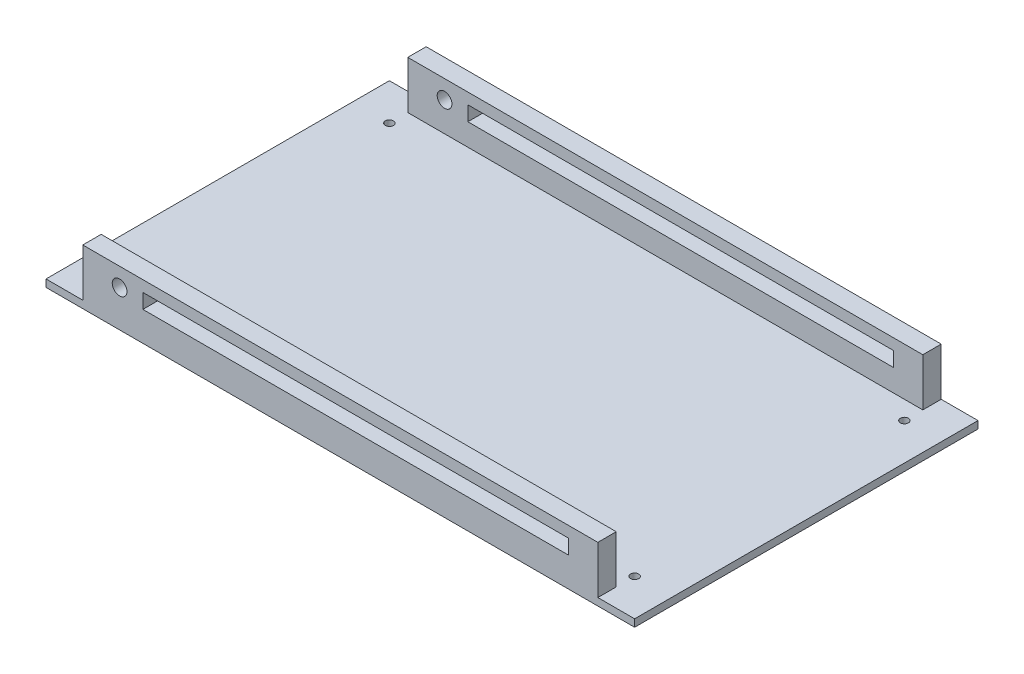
ISO-10303-21;
HEADER;
FILE_DESCRIPTION(('STEP AP214'),'2;1');
FILE_NAME('part.step','',(''),(''),'','','');
FILE_SCHEMA(('AUTOMOTIVE_DESIGN { 1 0 10303 214 1 1 1 1 }'));
ENDSEC;
DATA;
#1=APPLICATION_CONTEXT('core data for automotive mechanical design processes');
#2=APPLICATION_PROTOCOL_DEFINITION('international standard','automotive_design',2000,#1);
#3=PRODUCT_CONTEXT('',#1,'mechanical');
#4=PRODUCT('Part','Part','',(#3));
#5=PRODUCT_RELATED_PRODUCT_CATEGORY('part','',(#4));
#6=PRODUCT_DEFINITION_FORMATION('','',#4);
#7=PRODUCT_DEFINITION_CONTEXT('part definition',#1,'design');
#8=PRODUCT_DEFINITION('design','',#6,#7);
#9=PRODUCT_DEFINITION_SHAPE('','',#8);
#10=(LENGTH_UNIT() NAMED_UNIT(*) SI_UNIT(.MILLI.,.METRE.));
#11=(NAMED_UNIT(*) PLANE_ANGLE_UNIT() SI_UNIT($,.RADIAN.));
#12=(NAMED_UNIT(*) SI_UNIT($,.STERADIAN.) SOLID_ANGLE_UNIT());
#13=UNCERTAINTY_MEASURE_WITH_UNIT(LENGTH_MEASURE(1.E-05),#10,'distance_accuracy_value','');
#14=(GEOMETRIC_REPRESENTATION_CONTEXT(3) GLOBAL_UNCERTAINTY_ASSIGNED_CONTEXT((#13)) GLOBAL_UNIT_ASSIGNED_CONTEXT((#10,
#11,#12)) REPRESENTATION_CONTEXT('',''));
#15=CARTESIAN_POINT('',(0.,0.,0.));
#16=DIRECTION('',(0.,0.,1.));
#17=DIRECTION('',(1.,0.,0.));
#18=AXIS2_PLACEMENT_3D('',#15,#16,#17);
#19=CARTESIAN_POINT('',(210.,26.,-140.));
#20=DIRECTION('',(1.,0.,0.));
#21=DIRECTION('',(0.,0.,-1.));
#22=AXIS2_PLACEMENT_3D('',#19,#20,#21);
#23=PLANE('',#22);
#24=DIRECTION('',(0.,0.,1.));
#25=VECTOR('',#24,1.);
#26=CARTESIAN_POINT('',(210.,26.,-140.));
#27=LINE('',#26,#25);
#28=CARTESIAN_POINT('',(210.,26.,125.));
#29=VERTEX_POINT('',#28);
#30=CARTESIAN_POINT('',(210.,26.,140.));
#31=VERTEX_POINT('',#30);
#32=EDGE_CURVE('E257',#29,#31,#27,.T.);
#33=ORIENTED_EDGE('',*,*,#32,.F.);
#34=DIRECTION('',(0.,1.,0.));
#35=VECTOR('',#34,1.);
#36=CARTESIAN_POINT('',(210.,26.,125.));
#37=LINE('',#36,#35);
#38=CARTESIAN_POINT('',(210.,65.,125.));
#39=VERTEX_POINT('',#38);
#40=EDGE_CURVE('E228',#29,#39,#37,.T.);
#41=ORIENTED_EDGE('',*,*,#40,.T.);
#42=DIRECTION('',(0.,0.,1.));
#43=VECTOR('',#42,1.);
#44=CARTESIAN_POINT('',(210.,65.,-140.));
#45=LINE('',#44,#43);
#46=CARTESIAN_POINT('',(210.,65.,140.));
#47=VERTEX_POINT('',#46);
#48=EDGE_CURVE('E245',#39,#47,#45,.T.);
#49=ORIENTED_EDGE('',*,*,#48,.T.);
#50=DIRECTION('',(0.,1.,0.));
#51=VECTOR('',#50,1.);
#52=CARTESIAN_POINT('',(210.,26.,140.));
#53=LINE('',#52,#51);
#54=EDGE_CURVE('E235',#31,#47,#53,.T.);
#55=ORIENTED_EDGE('',*,*,#54,.F.);
#56=EDGE_LOOP('',(#33,#41,#49,#55));
#57=FACE_BOUND('',#56,.T.);
#58=ADVANCED_FACE('F41',(#57),#23,.T.);
#59=CARTESIAN_POINT('',(-210.,26.,-140.));
#60=DIRECTION('',(-1.,0.,0.));
#61=DIRECTION('',(0.,0.,1.));
#62=AXIS2_PLACEMENT_3D('',#59,#60,#61);
#63=PLANE('',#62);
#64=DIRECTION('',(0.,0.,1.));
#65=VECTOR('',#64,1.);
#66=CARTESIAN_POINT('',(-210.,65.,-140.));
#67=LINE('',#66,#65);
#68=CARTESIAN_POINT('',(-210.,65.,125.));
#69=VERTEX_POINT('',#68);
#70=CARTESIAN_POINT('',(-210.,65.,140.));
#71=VERTEX_POINT('',#70);
#72=EDGE_CURVE('E265',#69,#71,#67,.T.);
#73=ORIENTED_EDGE('',*,*,#72,.F.);
#74=DIRECTION('',(0.,-1.,0.));
#75=VECTOR('',#74,1.);
#76=CARTESIAN_POINT('',(-210.,26.,125.));
#77=LINE('',#76,#75);
#78=CARTESIAN_POINT('',(-210.,26.,125.));
#79=VERTEX_POINT('',#78);
#80=EDGE_CURVE('E223',#69,#79,#77,.T.);
#81=ORIENTED_EDGE('',*,*,#80,.T.);
#82=DIRECTION('',(0.,0.,1.));
#83=VECTOR('',#82,1.);
#84=CARTESIAN_POINT('',(-210.,26.,-140.));
#85=LINE('',#84,#83);
#86=CARTESIAN_POINT('',(-210.,26.,140.));
#87=VERTEX_POINT('',#86);
#88=EDGE_CURVE('E261',#79,#87,#85,.T.);
#89=ORIENTED_EDGE('',*,*,#88,.T.);
#90=DIRECTION('',(0.,-1.,0.));
#91=VECTOR('',#90,1.);
#92=CARTESIAN_POINT('',(-210.,26.,140.));
#93=LINE('',#92,#91);
#94=EDGE_CURVE('E240',#71,#87,#93,.T.);
#95=ORIENTED_EDGE('',*,*,#94,.F.);
#96=EDGE_LOOP('',(#73,#81,#89,#95));
#97=FACE_BOUND('',#96,.T.);
#98=ADVANCED_FACE('F388',(#97),#63,.T.);
#99=CARTESIAN_POINT('',(-210.,65.,-140.));
#100=DIRECTION('',(0.,1.,0.));
#101=DIRECTION('',(0.,0.,1.));
#102=AXIS2_PLACEMENT_3D('',#99,#100,#101);
#103=PLANE('',#102);
#104=ORIENTED_EDGE('',*,*,#48,.F.);
#105=DIRECTION('',(-1.,0.,0.));
#106=VECTOR('',#105,1.);
#107=CARTESIAN_POINT('',(-210.,65.,125.));
#108=LINE('',#107,#106);
#109=EDGE_CURVE('E297',#39,#69,#108,.T.);
#110=ORIENTED_EDGE('',*,*,#109,.T.);
#111=ORIENTED_EDGE('',*,*,#72,.T.);
#112=DIRECTION('',(-1.,0.,0.));
#113=VECTOR('',#112,1.);
#114=CARTESIAN_POINT('',(-210.,65.,140.));
#115=LINE('',#114,#113);
#116=EDGE_CURVE('E248',#47,#71,#115,.T.);
#117=ORIENTED_EDGE('',*,*,#116,.F.);
#118=EDGE_LOOP('',(#104,#110,#111,#117));
#119=FACE_BOUND('',#118,.T.);
#120=ADVANCED_FACE('F396',(#119),#103,.T.);
#121=CARTESIAN_POINT('',(240.,20.,-140.));
#122=DIRECTION('',(1.,0.,0.));
#123=DIRECTION('',(0.,0.,-1.));
#124=AXIS2_PLACEMENT_3D('',#121,#122,#123);
#125=PLANE('',#124);
#126=DIRECTION('',(0.,1.,0.));
#127=VECTOR('',#126,1.);
#128=CARTESIAN_POINT('',(240.,20.,140.));
#129=LINE('',#128,#127);
#130=CARTESIAN_POINT('',(240.,20.,140.));
#131=VERTEX_POINT('',#130);
#132=CARTESIAN_POINT('',(240.,26.,140.));
#133=VERTEX_POINT('',#132);
#134=EDGE_CURVE('E256',#131,#133,#129,.T.);
#135=ORIENTED_EDGE('',*,*,#134,.F.);
#136=DIRECTION('',(0.,0.,1.));
#137=VECTOR('',#136,1.);
#138=CARTESIAN_POINT('',(240.,20.,-140.));
#139=LINE('',#138,#137);
#140=CARTESIAN_POINT('',(240.,20.,-140.));
#141=VERTEX_POINT('',#140);
#142=EDGE_CURVE('E295',#141,#131,#139,.T.);
#143=ORIENTED_EDGE('',*,*,#142,.F.);
#144=DIRECTION('',(0.,1.,0.));
#145=VECTOR('',#144,1.);
#146=CARTESIAN_POINT('',(240.,20.,-140.));
#147=LINE('',#146,#145);
#148=CARTESIAN_POINT('',(240.,26.,-140.));
#149=VERTEX_POINT('',#148);
#150=EDGE_CURVE('E269',#141,#149,#147,.T.);
#151=ORIENTED_EDGE('',*,*,#150,.T.);
#152=DIRECTION('',(0.,0.,1.));
#153=VECTOR('',#152,1.);
#154=CARTESIAN_POINT('',(240.,26.,-140.));
#155=LINE('',#154,#153);
#156=EDGE_CURVE('E283',#149,#133,#155,.T.);
#157=ORIENTED_EDGE('',*,*,#156,.T.);
#158=EDGE_LOOP('',(#135,#143,#151,#157));
#159=FACE_BOUND('',#158,.T.);
#160=ADVANCED_FACE('F43',(#159),#125,.T.);
#161=CARTESIAN_POINT('',(-240.,20.,-140.));
#162=DIRECTION('',(0.,-1.,0.));
#163=DIRECTION('',(0.,0.,-1.));
#164=AXIS2_PLACEMENT_3D('',#161,#162,#163);
#165=PLANE('',#164);
#166=CARTESIAN_POINT('',(-210.,20.,-110.));
#167=DIRECTION('',(0.,-1.,0.));
#168=DIRECTION('',(0.,0.,-1.));
#169=AXIS2_PLACEMENT_3D('',#166,#167,#168);
#170=CIRCLE('',#169,3.3);
#171=CARTESIAN_POINT('',(-210.,20.,-113.3));
#172=VERTEX_POINT('',#171);
#173=EDGE_CURVE('E334',#172,#172,#170,.T.);
#174=ORIENTED_EDGE('',*,*,#173,.F.);
#175=EDGE_LOOP('',(#174));
#176=FACE_BOUND('',#175,.T.);
#177=CARTESIAN_POINT('',(210.,20.,110.));
#178=DIRECTION('',(0.,-1.,0.));
#179=DIRECTION('',(0.,0.,-1.));
#180=AXIS2_PLACEMENT_3D('',#177,#178,#179);
#181=CIRCLE('',#180,3.3);
#182=CARTESIAN_POINT('',(210.,20.,106.7));
#183=VERTEX_POINT('',#182);
#184=EDGE_CURVE('E323',#183,#183,#181,.T.);
#185=ORIENTED_EDGE('',*,*,#184,.F.);
#186=EDGE_LOOP('',(#185));
#187=FACE_BOUND('',#186,.T.);
#188=CARTESIAN_POINT('',(210.,20.,-110.));
#189=DIRECTION('',(0.,-1.,0.));
#190=DIRECTION('',(0.,0.,-1.));
#191=AXIS2_PLACEMENT_3D('',#188,#189,#190);
#192=CIRCLE('',#191,3.3);
#193=CARTESIAN_POINT('',(210.,20.,-113.3));
#194=VERTEX_POINT('',#193);
#195=EDGE_CURVE('E320',#194,#194,#192,.T.);
#196=ORIENTED_EDGE('',*,*,#195,.F.);
#197=EDGE_LOOP('',(#196));
#198=FACE_BOUND('',#197,.T.);
#199=CARTESIAN_POINT('',(-210.,20.,110.));
#200=DIRECTION('',(0.,-1.,0.));
#201=DIRECTION('',(0.,0.,-1.));
#202=AXIS2_PLACEMENT_3D('',#199,#200,#201);
#203=CIRCLE('',#202,3.3);
#204=CARTESIAN_POINT('',(-210.,20.,106.7));
#205=VERTEX_POINT('',#204);
#206=EDGE_CURVE('E317',#205,#205,#203,.T.);
#207=ORIENTED_EDGE('',*,*,#206,.F.);
#208=EDGE_LOOP('',(#207));
#209=FACE_BOUND('',#208,.T.);
#210=DIRECTION('',(1.,0.,0.));
#211=VECTOR('',#210,1.);
#212=CARTESIAN_POINT('',(-240.,20.,140.));
#213=LINE('',#212,#211);
#214=CARTESIAN_POINT('',(-240.,20.,140.));
#215=VERTEX_POINT('',#214);
#216=EDGE_CURVE('E273',#215,#131,#213,.T.);
#217=ORIENTED_EDGE('',*,*,#216,.F.);
#218=DIRECTION('',(0.,0.,1.));
#219=VECTOR('',#218,1.);
#220=CARTESIAN_POINT('',(-240.,20.,-140.));
#221=LINE('',#220,#219);
#222=CARTESIAN_POINT('',(-240.,20.,-140.));
#223=VERTEX_POINT('',#222);
#224=EDGE_CURVE('E298',#223,#215,#221,.T.);
#225=ORIENTED_EDGE('',*,*,#224,.F.);
#226=DIRECTION('',(1.,0.,0.));
#227=VECTOR('',#226,1.);
#228=CARTESIAN_POINT('',(-240.,20.,-140.));
#229=LINE('',#228,#227);
#230=EDGE_CURVE('E280',#223,#141,#229,.T.);
#231=ORIENTED_EDGE('',*,*,#230,.T.);
#232=ORIENTED_EDGE('',*,*,#142,.T.);
#233=EDGE_LOOP('',(#217,#225,#231,#232));
#234=FACE_BOUND('',#233,.T.);
#235=ADVANCED_FACE('F433',(#176,#187,#198,#209,#234),#165,.T.);
#236=CARTESIAN_POINT('',(-240.,20.,-140.));
#237=DIRECTION('',(-1.,0.,0.));
#238=DIRECTION('',(0.,0.,1.));
#239=AXIS2_PLACEMENT_3D('',#236,#237,#238);
#240=PLANE('',#239);
#241=DIRECTION('',(0.,-1.,0.));
#242=VECTOR('',#241,1.);
#243=CARTESIAN_POINT('',(-240.,20.,140.));
#244=LINE('',#243,#242);
#245=CARTESIAN_POINT('',(-240.,26.,140.));
#246=VERTEX_POINT('',#245);
#247=EDGE_CURVE('E290',#246,#215,#244,.T.);
#248=ORIENTED_EDGE('',*,*,#247,.F.);
#249=DIRECTION('',(0.,0.,1.));
#250=VECTOR('',#249,1.);
#251=CARTESIAN_POINT('',(-240.,26.,-140.));
#252=LINE('',#251,#250);
#253=CARTESIAN_POINT('',(-240.,26.,-140.));
#254=VERTEX_POINT('',#253);
#255=EDGE_CURVE('E300',#254,#246,#252,.T.);
#256=ORIENTED_EDGE('',*,*,#255,.F.);
#257=DIRECTION('',(0.,-1.,0.));
#258=VECTOR('',#257,1.);
#259=CARTESIAN_POINT('',(-240.,20.,-140.));
#260=LINE('',#259,#258);
#261=EDGE_CURVE('E277',#254,#223,#260,.T.);
#262=ORIENTED_EDGE('',*,*,#261,.T.);
#263=ORIENTED_EDGE('',*,*,#224,.T.);
#264=EDGE_LOOP('',(#248,#256,#262,#263));
#265=FACE_BOUND('',#264,.T.);
#266=ADVANCED_FACE('F440',(#265),#240,.T.);
#267=CARTESIAN_POINT('',(-240.,26.,-140.));
#268=DIRECTION('',(0.,1.,0.));
#269=DIRECTION('',(0.,0.,1.));
#270=AXIS2_PLACEMENT_3D('',#267,#268,#269);
#271=PLANE('',#270);
#272=CARTESIAN_POINT('',(-210.,26.,-110.));
#273=DIRECTION('',(0.,1.,0.));
#274=DIRECTION('',(0.,0.,1.));
#275=AXIS2_PLACEMENT_3D('',#272,#273,#274);
#276=CIRCLE('',#275,3.3);
#277=CARTESIAN_POINT('',(-210.,26.,-106.7));
#278=VERTEX_POINT('',#277);
#279=EDGE_CURVE('E45',#278,#278,#276,.T.);
#280=ORIENTED_EDGE('',*,*,#279,.F.);
#281=EDGE_LOOP('',(#280));
#282=FACE_BOUND('',#281,.T.);
#283=CARTESIAN_POINT('',(210.,26.,110.));
#284=DIRECTION('',(0.,1.,0.));
#285=DIRECTION('',(0.,0.,1.));
#286=AXIS2_PLACEMENT_3D('',#283,#284,#285);
#287=CIRCLE('',#286,3.3);
#288=CARTESIAN_POINT('',(210.,26.,113.3));
#289=VERTEX_POINT('',#288);
#290=EDGE_CURVE('E321',#289,#289,#287,.T.);
#291=ORIENTED_EDGE('',*,*,#290,.F.);
#292=EDGE_LOOP('',(#291));
#293=FACE_BOUND('',#292,.T.);
#294=CARTESIAN_POINT('',(210.,26.,-110.));
#295=DIRECTION('',(0.,1.,0.));
#296=DIRECTION('',(0.,0.,1.));
#297=AXIS2_PLACEMENT_3D('',#294,#295,#296);
#298=CIRCLE('',#297,3.3);
#299=CARTESIAN_POINT('',(210.,26.,-106.7));
#300=VERTEX_POINT('',#299);
#301=EDGE_CURVE('E318',#300,#300,#298,.T.);
#302=ORIENTED_EDGE('',*,*,#301,.F.);
#303=EDGE_LOOP('',(#302));
#304=FACE_BOUND('',#303,.T.);
#305=CARTESIAN_POINT('',(-210.,26.,110.));
#306=DIRECTION('',(0.,1.,0.));
#307=DIRECTION('',(0.,0.,1.));
#308=AXIS2_PLACEMENT_3D('',#305,#306,#307);
#309=CIRCLE('',#308,3.3);
#310=CARTESIAN_POINT('',(-210.,26.,113.3));
#311=VERTEX_POINT('',#310);
#312=EDGE_CURVE('E314',#311,#311,#309,.T.);
#313=ORIENTED_EDGE('',*,*,#312,.F.);
#314=EDGE_LOOP('',(#313));
#315=FACE_BOUND('',#314,.T.);
#316=CARTESIAN_POINT('',(210.,26.,-140.));
#317=VERTEX_POINT('',#316);
#318=CARTESIAN_POINT('',(210.,26.,-125.));
#319=VERTEX_POINT('',#318);
#320=EDGE_CURVE('E253',#317,#319,#27,.T.);
#321=ORIENTED_EDGE('',*,*,#320,.T.);
#322=DIRECTION('',(1.,0.,0.));
#323=VECTOR('',#322,1.);
#324=CARTESIAN_POINT('',(-215.,26.,-125.));
#325=LINE('',#324,#323);
#326=CARTESIAN_POINT('',(-210.,26.,-125.));
#327=VERTEX_POINT('',#326);
#328=EDGE_CURVE('E221',#327,#319,#325,.T.);
#329=ORIENTED_EDGE('',*,*,#328,.F.);
#330=CARTESIAN_POINT('',(-210.,26.,-140.));
#331=VERTEX_POINT('',#330);
#332=EDGE_CURVE('E258',#331,#327,#85,.T.);
#333=ORIENTED_EDGE('',*,*,#332,.F.);
#334=DIRECTION('',(-1.,0.,0.));
#335=VECTOR('',#334,1.);
#336=CARTESIAN_POINT('',(-240.,26.,-140.));
#337=LINE('',#336,#335);
#338=EDGE_CURVE('E272',#331,#254,#337,.T.);
#339=ORIENTED_EDGE('',*,*,#338,.T.);
#340=ORIENTED_EDGE('',*,*,#255,.T.);
#341=DIRECTION('',(-1.,0.,0.));
#342=VECTOR('',#341,1.);
#343=CARTESIAN_POINT('',(-240.,26.,140.));
#344=LINE('',#343,#342);
#345=EDGE_CURVE('E286',#87,#246,#344,.T.);
#346=ORIENTED_EDGE('',*,*,#345,.F.);
#347=ORIENTED_EDGE('',*,*,#88,.F.);
#348=DIRECTION('',(1.,0.,0.));
#349=VECTOR('',#348,1.);
#350=CARTESIAN_POINT('',(-215.,26.,125.));
#351=LINE('',#350,#349);
#352=EDGE_CURVE('E220',#79,#29,#351,.T.);
#353=ORIENTED_EDGE('',*,*,#352,.T.);
#354=ORIENTED_EDGE('',*,*,#32,.T.);
#355=EDGE_CURVE('E287',#133,#31,#344,.T.);
#356=ORIENTED_EDGE('',*,*,#355,.F.);
#357=ORIENTED_EDGE('',*,*,#156,.F.);
#358=EDGE_CURVE('E274',#149,#317,#337,.T.);
#359=ORIENTED_EDGE('',*,*,#358,.T.);
#360=EDGE_LOOP('',(#321,#329,#333,#339,#340,#346,#347,#353,#354,#356,#357,#359));
#361=FACE_BOUND('',#360,.T.);
#362=ADVANCED_FACE('F421',(#282,#293,#304,#315,#361),#271,.T.);
#363=CARTESIAN_POINT('',(0.,0.,-140.));
#364=DIRECTION('',(0.,0.,-1.));
#365=DIRECTION('',(-1.,0.,0.));
#366=AXIS2_PLACEMENT_3D('',#363,#364,#365);
#367=PLANE('',#366);
#368=DIRECTION('',(0.,-1.,0.));
#369=VECTOR('',#368,1.);
#370=CARTESIAN_POINT('',(186.,0.,-140.));
#371=LINE('',#370,#369);
#372=CARTESIAN_POINT('',(186.,56.,-140.));
#373=VERTEX_POINT('',#372);
#374=CARTESIAN_POINT('',(186.,44.,-140.));
#375=VERTEX_POINT('',#374);
#376=EDGE_CURVE('E191',#373,#375,#371,.T.);
#377=ORIENTED_EDGE('',*,*,#376,.F.);
#378=DIRECTION('',(1.,0.,0.));
#379=VECTOR('',#378,1.);
#380=CARTESIAN_POINT('',(0.,56.,-140.));
#381=LINE('',#380,#379);
#382=CARTESIAN_POINT('',(-161.,56.,-140.));
#383=VERTEX_POINT('',#382);
#384=EDGE_CURVE('E177',#383,#373,#381,.T.);
#385=ORIENTED_EDGE('',*,*,#384,.F.);
#386=DIRECTION('',(0.,1.,0.));
#387=VECTOR('',#386,1.);
#388=CARTESIAN_POINT('',(-161.,0.,-140.));
#389=LINE('',#388,#387);
#390=CARTESIAN_POINT('',(-161.,44.,-140.));
#391=VERTEX_POINT('',#390);
#392=EDGE_CURVE('E356',#391,#383,#389,.T.);
#393=ORIENTED_EDGE('',*,*,#392,.F.);
#394=DIRECTION('',(-1.,0.,0.));
#395=VECTOR('',#394,1.);
#396=CARTESIAN_POINT('',(0.,44.,-140.));
#397=LINE('',#396,#395);
#398=EDGE_CURVE('E201',#375,#391,#397,.T.);
#399=ORIENTED_EDGE('',*,*,#398,.F.);
#400=EDGE_LOOP('',(#377,#385,#393,#399));
#401=FACE_BOUND('',#400,.T.);
#402=CARTESIAN_POINT('',(-180.,50.,-140.));
#403=DIRECTION('',(0.,0.,-1.));
#404=DIRECTION('',(-1.,0.,0.));
#405=AXIS2_PLACEMENT_3D('',#402,#403,#404);
#406=CIRCLE('',#405,6.00000000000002);
#407=CARTESIAN_POINT('',(-186.,50.,-140.));
#408=VERTEX_POINT('',#407);
#409=EDGE_CURVE('E217',#408,#408,#406,.T.);
#410=ORIENTED_EDGE('',*,*,#409,.F.);
#411=EDGE_LOOP('',(#410));
#412=FACE_BOUND('',#411,.T.);
#413=ORIENTED_EDGE('',*,*,#150,.F.);
#414=ORIENTED_EDGE('',*,*,#230,.F.);
#415=ORIENTED_EDGE('',*,*,#261,.F.);
#416=ORIENTED_EDGE('',*,*,#338,.F.);
#417=DIRECTION('',(0.,-1.,0.));
#418=VECTOR('',#417,1.);
#419=CARTESIAN_POINT('',(-210.,26.,-140.));
#420=LINE('',#419,#418);
#421=CARTESIAN_POINT('',(-210.,65.,-140.));
#422=VERTEX_POINT('',#421);
#423=EDGE_CURVE('E243',#422,#331,#420,.T.);
#424=ORIENTED_EDGE('',*,*,#423,.F.);
#425=DIRECTION('',(-1.,0.,0.));
#426=VECTOR('',#425,1.);
#427=CARTESIAN_POINT('',(-210.,65.,-140.));
#428=LINE('',#427,#426);
#429=CARTESIAN_POINT('',(210.,65.,-140.));
#430=VERTEX_POINT('',#429);
#431=EDGE_CURVE('E239',#430,#422,#428,.T.);
#432=ORIENTED_EDGE('',*,*,#431,.F.);
#433=DIRECTION('',(0.,1.,0.));
#434=VECTOR('',#433,1.);
#435=CARTESIAN_POINT('',(210.,26.,-140.));
#436=LINE('',#435,#434);
#437=EDGE_CURVE('E236',#317,#430,#436,.T.);
#438=ORIENTED_EDGE('',*,*,#437,.F.);
#439=ORIENTED_EDGE('',*,*,#358,.F.);
#440=EDGE_LOOP('',(#413,#414,#415,#416,#424,#432,#438,#439));
#441=FACE_BOUND('',#440,.T.);
#442=ADVANCED_FACE('F199',(#401,#412,#441),#367,.T.);
#443=CARTESIAN_POINT('',(0.,0.,140.));
#444=DIRECTION('',(0.,0.,-1.));
#445=DIRECTION('',(-1.,0.,0.));
#446=AXIS2_PLACEMENT_3D('',#443,#444,#445);
#447=PLANE('',#446);
#448=DIRECTION('',(1.,0.,0.));
#449=VECTOR('',#448,1.);
#450=CARTESIAN_POINT('',(0.,56.,140.));
#451=LINE('',#450,#449);
#452=CARTESIAN_POINT('',(-161.,56.,140.));
#453=VERTEX_POINT('',#452);
#454=CARTESIAN_POINT('',(186.,56.,140.));
#455=VERTEX_POINT('',#454);
#456=EDGE_CURVE('E186',#453,#455,#451,.T.);
#457=ORIENTED_EDGE('',*,*,#456,.T.);
#458=DIRECTION('',(0.,-1.,0.));
#459=VECTOR('',#458,1.);
#460=CARTESIAN_POINT('',(186.,0.,140.));
#461=LINE('',#460,#459);
#462=CARTESIAN_POINT('',(186.,44.,140.));
#463=VERTEX_POINT('',#462);
#464=EDGE_CURVE('E203',#455,#463,#461,.T.);
#465=ORIENTED_EDGE('',*,*,#464,.T.);
#466=DIRECTION('',(-1.,0.,0.));
#467=VECTOR('',#466,1.);
#468=CARTESIAN_POINT('',(0.,44.,140.));
#469=LINE('',#468,#467);
#470=CARTESIAN_POINT('',(-161.,44.,140.));
#471=VERTEX_POINT('',#470);
#472=EDGE_CURVE('E361',#463,#471,#469,.T.);
#473=ORIENTED_EDGE('',*,*,#472,.T.);
#474=DIRECTION('',(0.,1.,0.));
#475=VECTOR('',#474,1.);
#476=CARTESIAN_POINT('',(-161.,0.,140.));
#477=LINE('',#476,#475);
#478=EDGE_CURVE('E353',#471,#453,#477,.T.);
#479=ORIENTED_EDGE('',*,*,#478,.T.);
#480=EDGE_LOOP('',(#457,#465,#473,#479));
#481=FACE_BOUND('',#480,.T.);
#482=CARTESIAN_POINT('',(-180.,50.,140.));
#483=DIRECTION('',(0.,0.,-1.));
#484=DIRECTION('',(-1.,0.,0.));
#485=AXIS2_PLACEMENT_3D('',#482,#483,#484);
#486=CIRCLE('',#485,6.00000000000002);
#487=CARTESIAN_POINT('',(-186.,50.,140.));
#488=VERTEX_POINT('',#487);
#489=EDGE_CURVE('E214',#488,#488,#486,.T.);
#490=ORIENTED_EDGE('',*,*,#489,.T.);
#491=EDGE_LOOP('',(#490));
#492=FACE_BOUND('',#491,.T.);
#493=ORIENTED_EDGE('',*,*,#134,.T.);
#494=ORIENTED_EDGE('',*,*,#355,.T.);
#495=ORIENTED_EDGE('',*,*,#54,.T.);
#496=ORIENTED_EDGE('',*,*,#116,.T.);
#497=ORIENTED_EDGE('',*,*,#94,.T.);
#498=ORIENTED_EDGE('',*,*,#345,.T.);
#499=ORIENTED_EDGE('',*,*,#247,.T.);
#500=ORIENTED_EDGE('',*,*,#216,.T.);
#501=EDGE_LOOP('',(#493,#494,#495,#496,#497,#498,#499,#500));
#502=FACE_BOUND('',#501,.T.);
#503=ADVANCED_FACE('F404',(#481,#492,#502),#447,.F.);
#504=DIRECTION('',(0.,1.,0.));
#505=VECTOR('',#504,1.);
#506=CARTESIAN_POINT('',(210.,26.,-125.));
#507=LINE('',#506,#505);
#508=CARTESIAN_POINT('',(210.,65.,-125.));
#509=VERTEX_POINT('',#508);
#510=EDGE_CURVE('E233',#319,#509,#507,.T.);
#511=ORIENTED_EDGE('',*,*,#510,.F.);
#512=ORIENTED_EDGE('',*,*,#320,.F.);
#513=ORIENTED_EDGE('',*,*,#437,.T.);
#514=EDGE_CURVE('E266',#430,#509,#45,.T.);
#515=ORIENTED_EDGE('',*,*,#514,.T.);
#516=EDGE_LOOP('',(#511,#512,#513,#515));
#517=FACE_BOUND('',#516,.T.);
#518=ADVANCED_FACE('F391',(#517),#23,.T.);
#519=DIRECTION('',(0.,-1.,0.));
#520=VECTOR('',#519,1.);
#521=CARTESIAN_POINT('',(-210.,26.,-125.));
#522=LINE('',#521,#520);
#523=CARTESIAN_POINT('',(-210.,65.,-125.));
#524=VERTEX_POINT('',#523);
#525=EDGE_CURVE('E231',#524,#327,#522,.T.);
#526=ORIENTED_EDGE('',*,*,#525,.F.);
#527=EDGE_CURVE('E262',#422,#524,#67,.T.);
#528=ORIENTED_EDGE('',*,*,#527,.F.);
#529=ORIENTED_EDGE('',*,*,#423,.T.);
#530=ORIENTED_EDGE('',*,*,#332,.T.);
#531=EDGE_LOOP('',(#526,#528,#529,#530));
#532=FACE_BOUND('',#531,.T.);
#533=ADVANCED_FACE('F399',(#532),#63,.T.);
#534=DIRECTION('',(-1.,0.,0.));
#535=VECTOR('',#534,1.);
#536=CARTESIAN_POINT('',(-210.,65.,-125.));
#537=LINE('',#536,#535);
#538=EDGE_CURVE('E306',#509,#524,#537,.T.);
#539=ORIENTED_EDGE('',*,*,#538,.F.);
#540=ORIENTED_EDGE('',*,*,#514,.F.);
#541=ORIENTED_EDGE('',*,*,#431,.T.);
#542=ORIENTED_EDGE('',*,*,#527,.T.);
#543=EDGE_LOOP('',(#539,#540,#541,#542));
#544=FACE_BOUND('',#543,.T.);
#545=ADVANCED_FACE('F410',(#544),#103,.T.);
#546=CARTESIAN_POINT('',(0.,0.,-125.));
#547=DIRECTION('',(0.,0.,-1.));
#548=DIRECTION('',(-1.,0.,0.));
#549=AXIS2_PLACEMENT_3D('',#546,#547,#548);
#550=PLANE('',#549);
#551=DIRECTION('',(1.,0.,0.));
#552=VECTOR('',#551,1.);
#553=CARTESIAN_POINT('',(0.,56.,-125.));
#554=LINE('',#553,#552);
#555=CARTESIAN_POINT('',(-161.,56.,-125.));
#556=VERTEX_POINT('',#555);
#557=CARTESIAN_POINT('',(186.,56.,-125.));
#558=VERTEX_POINT('',#557);
#559=EDGE_CURVE('E347',#556,#558,#554,.T.);
#560=ORIENTED_EDGE('',*,*,#559,.T.);
#561=DIRECTION('',(0.,-1.,0.));
#562=VECTOR('',#561,1.);
#563=CARTESIAN_POINT('',(186.,0.,-125.));
#564=LINE('',#563,#562);
#565=CARTESIAN_POINT('',(186.,44.,-125.));
#566=VERTEX_POINT('',#565);
#567=EDGE_CURVE('E194',#558,#566,#564,.T.);
#568=ORIENTED_EDGE('',*,*,#567,.T.);
#569=DIRECTION('',(-1.,0.,0.));
#570=VECTOR('',#569,1.);
#571=CARTESIAN_POINT('',(0.,44.,-125.));
#572=LINE('',#571,#570);
#573=CARTESIAN_POINT('',(-161.,44.,-125.));
#574=VERTEX_POINT('',#573);
#575=EDGE_CURVE('E358',#566,#574,#572,.T.);
#576=ORIENTED_EDGE('',*,*,#575,.T.);
#577=DIRECTION('',(0.,1.,0.));
#578=VECTOR('',#577,1.);
#579=CARTESIAN_POINT('',(-161.,0.,-125.));
#580=LINE('',#579,#578);
#581=EDGE_CURVE('E185',#574,#556,#580,.T.);
#582=ORIENTED_EDGE('',*,*,#581,.T.);
#583=EDGE_LOOP('',(#560,#568,#576,#582));
#584=FACE_BOUND('',#583,.T.);
#585=CARTESIAN_POINT('',(-180.,50.,-125.));
#586=DIRECTION('',(0.,0.,-1.));
#587=DIRECTION('',(-1.,0.,0.));
#588=AXIS2_PLACEMENT_3D('',#585,#586,#587);
#589=CIRCLE('',#588,6.00000000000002);
#590=CARTESIAN_POINT('',(-186.,50.,-125.));
#591=VERTEX_POINT('',#590);
#592=EDGE_CURVE('E206',#591,#591,#589,.T.);
#593=ORIENTED_EDGE('',*,*,#592,.T.);
#594=EDGE_LOOP('',(#593));
#595=FACE_BOUND('',#594,.T.);
#596=ORIENTED_EDGE('',*,*,#510,.T.);
#597=ORIENTED_EDGE('',*,*,#538,.T.);
#598=ORIENTED_EDGE('',*,*,#525,.T.);
#599=ORIENTED_EDGE('',*,*,#328,.T.);
#600=EDGE_LOOP('',(#596,#597,#598,#599));
#601=FACE_BOUND('',#600,.T.);
#602=ADVANCED_FACE('F365',(#584,#595,#601),#550,.F.);
#603=CARTESIAN_POINT('',(0.,0.,125.));
#604=DIRECTION('',(0.,0.,-1.));
#605=DIRECTION('',(-1.,0.,0.));
#606=AXIS2_PLACEMENT_3D('',#603,#604,#605);
#607=PLANE('',#606);
#608=DIRECTION('',(0.,-1.,0.));
#609=VECTOR('',#608,1.);
#610=CARTESIAN_POINT('',(186.,0.,125.));
#611=LINE('',#610,#609);
#612=CARTESIAN_POINT('',(186.,56.,125.));
#613=VERTEX_POINT('',#612);
#614=CARTESIAN_POINT('',(186.,44.,125.));
#615=VERTEX_POINT('',#614);
#616=EDGE_CURVE('E11',#613,#615,#611,.T.);
#617=ORIENTED_EDGE('',*,*,#616,.F.);
#618=DIRECTION('',(1.,0.,0.));
#619=VECTOR('',#618,1.);
#620=CARTESIAN_POINT('',(0.,56.,125.));
#621=LINE('',#620,#619);
#622=CARTESIAN_POINT('',(-161.,56.,125.));
#623=VERTEX_POINT('',#622);
#624=EDGE_CURVE('E307',#623,#613,#621,.T.);
#625=ORIENTED_EDGE('',*,*,#624,.F.);
#626=DIRECTION('',(0.,1.,0.));
#627=VECTOR('',#626,1.);
#628=CARTESIAN_POINT('',(-161.,0.,125.));
#629=LINE('',#628,#627);
#630=CARTESIAN_POINT('',(-161.,44.,125.));
#631=VERTEX_POINT('',#630);
#632=EDGE_CURVE('E310',#631,#623,#629,.T.);
#633=ORIENTED_EDGE('',*,*,#632,.F.);
#634=DIRECTION('',(-1.,0.,0.));
#635=VECTOR('',#634,1.);
#636=CARTESIAN_POINT('',(0.,44.,125.));
#637=LINE('',#636,#635);
#638=EDGE_CURVE('E50',#615,#631,#637,.T.);
#639=ORIENTED_EDGE('',*,*,#638,.F.);
#640=EDGE_LOOP('',(#617,#625,#633,#639));
#641=FACE_BOUND('',#640,.T.);
#642=CARTESIAN_POINT('',(-180.,50.,125.));
#643=DIRECTION('',(0.,0.,-1.));
#644=DIRECTION('',(-1.,0.,0.));
#645=AXIS2_PLACEMENT_3D('',#642,#643,#644);
#646=CIRCLE('',#645,6.00000000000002);
#647=CARTESIAN_POINT('',(-186.,50.,125.));
#648=VERTEX_POINT('',#647);
#649=EDGE_CURVE('E202',#648,#648,#646,.T.);
#650=ORIENTED_EDGE('',*,*,#649,.F.);
#651=EDGE_LOOP('',(#650));
#652=FACE_BOUND('',#651,.T.);
#653=ORIENTED_EDGE('',*,*,#352,.F.);
#654=ORIENTED_EDGE('',*,*,#80,.F.);
#655=ORIENTED_EDGE('',*,*,#109,.F.);
#656=ORIENTED_EDGE('',*,*,#40,.F.);
#657=EDGE_LOOP('',(#653,#654,#655,#656));
#658=FACE_BOUND('',#657,.T.);
#659=ADVANCED_FACE('F446',(#641,#652,#658),#607,.T.);
#660=CARTESIAN_POINT('',(-180.,50.,-500.));
#661=DIRECTION('',(0.,0.,1.));
#662=DIRECTION('',(1.,0.,0.));
#663=AXIS2_PLACEMENT_3D('',#660,#661,#662);
#664=CYLINDRICAL_SURFACE('',#663,6.00000000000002);
#665=ORIENTED_EDGE('',*,*,#649,.T.);
#666=EDGE_LOOP('',(#665));
#667=FACE_BOUND('',#666,.T.);
#668=ORIENTED_EDGE('',*,*,#489,.F.);
#669=EDGE_LOOP('',(#668));
#670=FACE_BOUND('',#669,.T.);
#671=ADVANCED_FACE('F451',(#667,#670),#664,.F.);
#672=ORIENTED_EDGE('',*,*,#409,.T.);
#673=EDGE_LOOP('',(#672));
#674=FACE_BOUND('',#673,.T.);
#675=ORIENTED_EDGE('',*,*,#592,.F.);
#676=EDGE_LOOP('',(#675));
#677=FACE_BOUND('',#676,.T.);
#678=ADVANCED_FACE('F457',(#674,#677),#664,.F.);
#679=CARTESIAN_POINT('',(-161.,56.,-500.));
#680=DIRECTION('',(0.,1.,0.));
#681=DIRECTION('',(0.,0.,1.));
#682=AXIS2_PLACEMENT_3D('',#679,#680,#681);
#683=PLANE('',#682);
#684=DIRECTION('',(0.,0.,1.));
#685=VECTOR('',#684,1.);
#686=CARTESIAN_POINT('',(-161.,56.,-500.));
#687=LINE('',#686,#685);
#688=EDGE_CURVE('E196',#623,#453,#687,.T.);
#689=ORIENTED_EDGE('',*,*,#688,.F.);
#690=ORIENTED_EDGE('',*,*,#624,.T.);
#691=DIRECTION('',(0.,0.,1.));
#692=VECTOR('',#691,1.);
#693=CARTESIAN_POINT('',(186.,56.,-500.));
#694=LINE('',#693,#692);
#695=EDGE_CURVE('E66',#613,#455,#694,.T.);
#696=ORIENTED_EDGE('',*,*,#695,.T.);
#697=ORIENTED_EDGE('',*,*,#456,.F.);
#698=EDGE_LOOP('',(#689,#690,#696,#697));
#699=FACE_BOUND('',#698,.T.);
#700=ADVANCED_FACE('F462',(#699),#683,.F.);
#701=CARTESIAN_POINT('',(-161.,44.,-500.));
#702=DIRECTION('',(-1.,0.,0.));
#703=DIRECTION('',(0.,0.,1.));
#704=AXIS2_PLACEMENT_3D('',#701,#702,#703);
#705=PLANE('',#704);
#706=DIRECTION('',(0.,0.,1.));
#707=VECTOR('',#706,1.);
#708=CARTESIAN_POINT('',(-161.,44.,-500.));
#709=LINE('',#708,#707);
#710=EDGE_CURVE('E342',#631,#471,#709,.T.);
#711=ORIENTED_EDGE('',*,*,#710,.F.);
#712=ORIENTED_EDGE('',*,*,#632,.T.);
#713=ORIENTED_EDGE('',*,*,#688,.T.);
#714=ORIENTED_EDGE('',*,*,#478,.F.);
#715=EDGE_LOOP('',(#711,#712,#713,#714));
#716=FACE_BOUND('',#715,.T.);
#717=ADVANCED_FACE('F381',(#716),#705,.F.);
#718=CARTESIAN_POINT('',(-161.,44.,-500.));
#719=DIRECTION('',(0.,-1.,0.));
#720=DIRECTION('',(0.,0.,-1.));
#721=AXIS2_PLACEMENT_3D('',#718,#719,#720);
#722=PLANE('',#721);
#723=DIRECTION('',(0.,0.,1.));
#724=VECTOR('',#723,1.);
#725=CARTESIAN_POINT('',(186.,44.,-500.));
#726=LINE('',#725,#724);
#727=EDGE_CURVE('E337',#615,#463,#726,.T.);
#728=ORIENTED_EDGE('',*,*,#727,.F.);
#729=ORIENTED_EDGE('',*,*,#638,.T.);
#730=ORIENTED_EDGE('',*,*,#710,.T.);
#731=ORIENTED_EDGE('',*,*,#472,.F.);
#732=EDGE_LOOP('',(#728,#729,#730,#731));
#733=FACE_BOUND('',#732,.T.);
#734=ADVANCED_FACE('F375',(#733),#722,.F.);
#735=CARTESIAN_POINT('',(186.,44.,-500.));
#736=DIRECTION('',(1.,0.,0.));
#737=DIRECTION('',(0.,0.,-1.));
#738=AXIS2_PLACEMENT_3D('',#735,#736,#737);
#739=PLANE('',#738);
#740=ORIENTED_EDGE('',*,*,#695,.F.);
#741=ORIENTED_EDGE('',*,*,#616,.T.);
#742=ORIENTED_EDGE('',*,*,#727,.T.);
#743=ORIENTED_EDGE('',*,*,#464,.F.);
#744=EDGE_LOOP('',(#740,#741,#742,#743));
#745=FACE_BOUND('',#744,.T.);
#746=ADVANCED_FACE('F382',(#745),#739,.F.);
#747=ORIENTED_EDGE('',*,*,#376,.T.);
#748=EDGE_CURVE('E340',#375,#566,#726,.T.);
#749=ORIENTED_EDGE('',*,*,#748,.T.);
#750=ORIENTED_EDGE('',*,*,#567,.F.);
#751=EDGE_CURVE('E180',#373,#558,#694,.T.);
#752=ORIENTED_EDGE('',*,*,#751,.F.);
#753=EDGE_LOOP('',(#747,#749,#750,#752));
#754=FACE_BOUND('',#753,.T.);
#755=ADVANCED_FACE('F189',(#754),#739,.F.);
#756=ORIENTED_EDGE('',*,*,#398,.T.);
#757=EDGE_CURVE('E341',#391,#574,#709,.T.);
#758=ORIENTED_EDGE('',*,*,#757,.T.);
#759=ORIENTED_EDGE('',*,*,#575,.F.);
#760=ORIENTED_EDGE('',*,*,#748,.F.);
#761=EDGE_LOOP('',(#756,#758,#759,#760));
#762=FACE_BOUND('',#761,.T.);
#763=ADVANCED_FACE('F372',(#762),#722,.F.);
#764=ORIENTED_EDGE('',*,*,#392,.T.);
#765=EDGE_CURVE('E58',#383,#556,#687,.T.);
#766=ORIENTED_EDGE('',*,*,#765,.T.);
#767=ORIENTED_EDGE('',*,*,#581,.F.);
#768=ORIENTED_EDGE('',*,*,#757,.F.);
#769=EDGE_LOOP('',(#764,#766,#767,#768));
#770=FACE_BOUND('',#769,.T.);
#771=ADVANCED_FACE('F368',(#770),#705,.F.);
#772=ORIENTED_EDGE('',*,*,#384,.T.);
#773=ORIENTED_EDGE('',*,*,#751,.T.);
#774=ORIENTED_EDGE('',*,*,#559,.F.);
#775=ORIENTED_EDGE('',*,*,#765,.F.);
#776=EDGE_LOOP('',(#772,#773,#774,#775));
#777=FACE_BOUND('',#776,.T.);
#778=ADVANCED_FACE('F179',(#777),#683,.F.);
#779=CARTESIAN_POINT('',(-210.,-50.,110.));
#780=DIRECTION('',(0.,1.,0.));
#781=DIRECTION('',(0.,0.,1.));
#782=AXIS2_PLACEMENT_3D('',#779,#780,#781);
#783=CYLINDRICAL_SURFACE('',#782,3.3);
#784=ORIENTED_EDGE('',*,*,#206,.T.);
#785=EDGE_LOOP('',(#784));
#786=FACE_BOUND('',#785,.T.);
#787=ORIENTED_EDGE('',*,*,#312,.T.);
#788=EDGE_LOOP('',(#787));
#789=FACE_BOUND('',#788,.T.);
#790=ADVANCED_FACE('F513',(#786,#789),#783,.F.);
#791=CARTESIAN_POINT('',(210.,-50.,-110.));
#792=DIRECTION('',(0.,1.,0.));
#793=DIRECTION('',(0.,0.,1.));
#794=AXIS2_PLACEMENT_3D('',#791,#792,#793);
#795=CYLINDRICAL_SURFACE('',#794,3.3);
#796=ORIENTED_EDGE('',*,*,#195,.T.);
#797=EDGE_LOOP('',(#796));
#798=FACE_BOUND('',#797,.T.);
#799=ORIENTED_EDGE('',*,*,#301,.T.);
#800=EDGE_LOOP('',(#799));
#801=FACE_BOUND('',#800,.T.);
#802=ADVANCED_FACE('F514',(#798,#801),#795,.F.);
#803=CARTESIAN_POINT('',(210.,-50.,110.));
#804=DIRECTION('',(0.,1.,0.));
#805=DIRECTION('',(0.,0.,1.));
#806=AXIS2_PLACEMENT_3D('',#803,#804,#805);
#807=CYLINDRICAL_SURFACE('',#806,3.3);
#808=ORIENTED_EDGE('',*,*,#184,.T.);
#809=EDGE_LOOP('',(#808));
#810=FACE_BOUND('',#809,.T.);
#811=ORIENTED_EDGE('',*,*,#290,.T.);
#812=EDGE_LOOP('',(#811));
#813=FACE_BOUND('',#812,.T.);
#814=ADVANCED_FACE('F519',(#810,#813),#807,.F.);
#815=CARTESIAN_POINT('',(-210.,-50.,-110.));
#816=DIRECTION('',(0.,1.,0.));
#817=DIRECTION('',(0.,0.,1.));
#818=AXIS2_PLACEMENT_3D('',#815,#816,#817);
#819=CYLINDRICAL_SURFACE('',#818,3.3);
#820=ORIENTED_EDGE('',*,*,#173,.T.);
#821=EDGE_LOOP('',(#820));
#822=FACE_BOUND('',#821,.T.);
#823=ORIENTED_EDGE('',*,*,#279,.T.);
#824=EDGE_LOOP('',(#823));
#825=FACE_BOUND('',#824,.T.);
#826=ADVANCED_FACE('F525',(#822,#825),#819,.F.);
#827=CLOSED_SHELL('',(#58,#98,#120,#160,#235,#266,#362,#442,#503,#518,#533,#545,#602,#659,#671,
#678,#700,#717,#734,#746,#755,#763,#771,#778,#790,#802,#814,#826));
#828=MANIFOLD_SOLID_BREP('B2',#827);
#829=ADVANCED_BREP_SHAPE_REPRESENTATION('',(#18,#828),#14);
#830=SHAPE_DEFINITION_REPRESENTATION(#9,#829);
ENDSEC;
END-ISO-10303-21;
